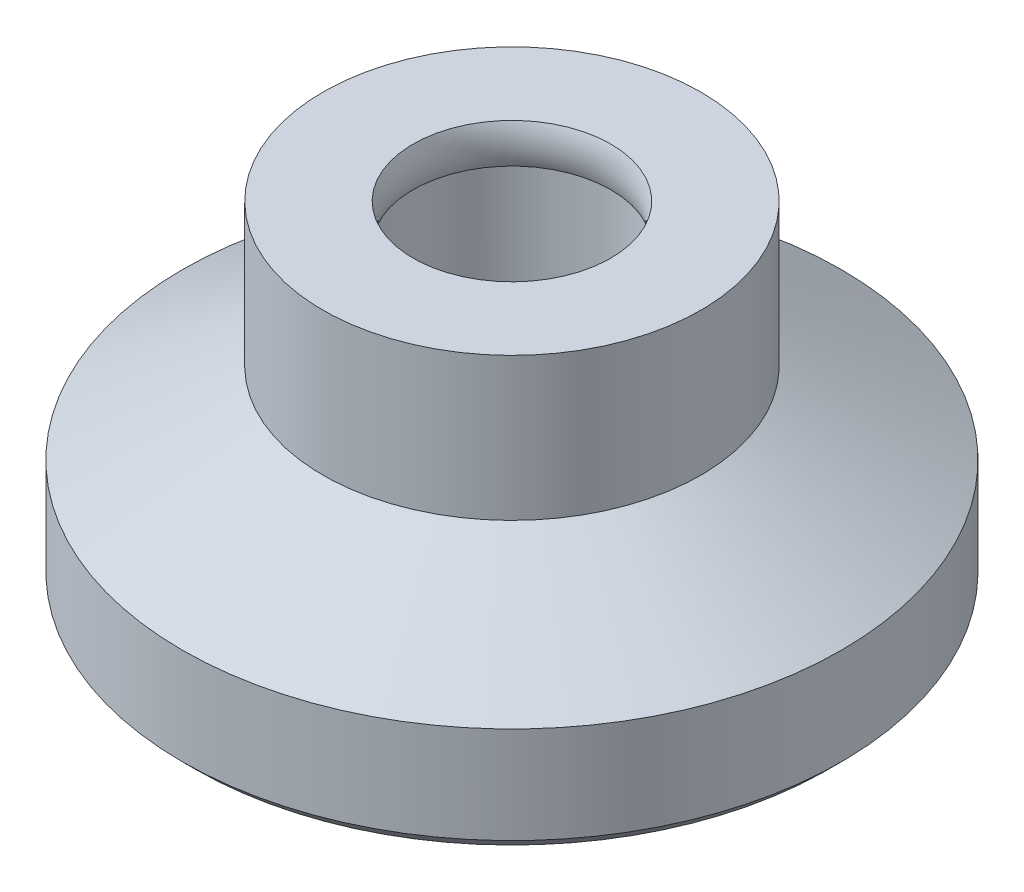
ISO-10303-21;
HEADER;
FILE_DESCRIPTION(('STEP AP214'),'2;1');
FILE_NAME('part.step','',(''),(''),'','','');
FILE_SCHEMA(('AUTOMOTIVE_DESIGN { 1 0 10303 214 1 1 1 1 }'));
ENDSEC;
DATA;
#1=APPLICATION_CONTEXT('core data for automotive mechanical design processes');
#2=APPLICATION_PROTOCOL_DEFINITION('international standard','automotive_design',2000,#1);
#3=PRODUCT_CONTEXT('',#1,'mechanical');
#4=PRODUCT('Part','Part','',(#3));
#5=PRODUCT_RELATED_PRODUCT_CATEGORY('part','',(#4));
#6=PRODUCT_DEFINITION_FORMATION('','',#4);
#7=PRODUCT_DEFINITION_CONTEXT('part definition',#1,'design');
#8=PRODUCT_DEFINITION('design','',#6,#7);
#9=PRODUCT_DEFINITION_SHAPE('','',#8);
#10=(LENGTH_UNIT() NAMED_UNIT(*) SI_UNIT(.MILLI.,.METRE.));
#11=(NAMED_UNIT(*) PLANE_ANGLE_UNIT() SI_UNIT($,.RADIAN.));
#12=(NAMED_UNIT(*) SI_UNIT($,.STERADIAN.) SOLID_ANGLE_UNIT());
#13=UNCERTAINTY_MEASURE_WITH_UNIT(LENGTH_MEASURE(1.E-05),#10,'distance_accuracy_value','');
#14=(GEOMETRIC_REPRESENTATION_CONTEXT(3) GLOBAL_UNCERTAINTY_ASSIGNED_CONTEXT((#13)) GLOBAL_UNIT_ASSIGNED_CONTEXT((#10,
#11,#12)) REPRESENTATION_CONTEXT('',''));
#15=CARTESIAN_POINT('',(0.,0.,0.));
#16=DIRECTION('',(0.,0.,1.));
#17=DIRECTION('',(1.,0.,0.));
#18=AXIS2_PLACEMENT_3D('',#15,#16,#17);
#19=CARTESIAN_POINT('',(0.,3.8,0.));
#20=DIRECTION('',(0.,-1.,0.));
#21=DIRECTION('',(0.,0.,-1.));
#22=AXIS2_PLACEMENT_3D('',#19,#20,#21);
#23=CYLINDRICAL_SURFACE('',#22,4.3);
#24=CARTESIAN_POINT('',(0.,0.547520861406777,0.));
#25=DIRECTION('',(0.,1.,0.));
#26=DIRECTION('',(0.,0.,1.));
#27=AXIS2_PLACEMENT_3D('',#24,#25,#26);
#28=CIRCLE('',#27,4.3);
#29=CARTESIAN_POINT('',(0.,0.547520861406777,-4.3));
#30=VERTEX_POINT('',#29);
#31=EDGE_CURVE('E91',#30,#30,#28,.T.);
#32=CARTESIAN_POINT('',(0.,3.8,0.));
#33=DIRECTION('',(0.,1.,0.));
#34=DIRECTION('',(0.,0.,1.));
#35=AXIS2_PLACEMENT_3D('',#32,#33,#34);
#36=CIRCLE('',#35,4.3);
#37=CARTESIAN_POINT('',(0.,3.8,-4.3));
#38=VERTEX_POINT('',#37);
#39=EDGE_CURVE('E93',#38,#38,#36,.T.);
#40=CARTESIAN_POINT('',(0.,0.547520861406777,-4.3));
#41=CARTESIAN_POINT('',(0.,0.58140085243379,-4.3));
#42=CARTESIAN_POINT('',(0.,0.615280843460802,-4.3));
#43=CARTESIAN_POINT('',(0.,0.683040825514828,-4.3));
#44=CARTESIAN_POINT('',(0.,0.71692081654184,-4.3));
#45=CARTESIAN_POINT('',(0.,0.784680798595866,-4.3));
#46=CARTESIAN_POINT('',(0.,0.818560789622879,-4.3));
#47=CARTESIAN_POINT('',(0.,0.886320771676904,-4.3));
#48=CARTESIAN_POINT('',(0.,0.920200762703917,-4.3));
#49=CARTESIAN_POINT('',(0.,0.987960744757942,-4.3));
#50=CARTESIAN_POINT('',(0.,1.02184073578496,-4.3));
#51=CARTESIAN_POINT('',(0.,1.08960071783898,-4.3));
#52=CARTESIAN_POINT('',(0.,1.12348070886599,-4.3));
#53=CARTESIAN_POINT('',(0.,1.19124069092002,-4.3));
#54=CARTESIAN_POINT('',(0.,1.22512068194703,-4.3));
#55=CARTESIAN_POINT('',(0.,1.29288066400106,-4.3));
#56=CARTESIAN_POINT('',(0.,1.32676065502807,-4.3));
#57=CARTESIAN_POINT('',(0.,1.3945206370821,-4.3));
#58=CARTESIAN_POINT('',(0.,1.42840062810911,-4.3));
#59=CARTESIAN_POINT('',(0.,1.49616061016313,-4.3));
#60=CARTESIAN_POINT('',(0.,1.53004060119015,-4.3));
#61=CARTESIAN_POINT('',(0.,1.59780058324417,-4.3));
#62=CARTESIAN_POINT('',(0.,1.63168057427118,-4.3));
#63=CARTESIAN_POINT('',(0.,1.69944055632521,-4.3));
#64=CARTESIAN_POINT('',(0.,1.73332054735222,-4.3));
#65=CARTESIAN_POINT('',(0.,1.80108052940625,-4.3));
#66=CARTESIAN_POINT('',(0.,1.83496052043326,-4.3));
#67=CARTESIAN_POINT('',(0.,1.90272050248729,-4.3));
#68=CARTESIAN_POINT('',(0.,1.9366004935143,-4.3));
#69=CARTESIAN_POINT('',(0.,2.00436047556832,-4.3));
#70=CARTESIAN_POINT('',(0.,2.03824046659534,-4.3));
#71=CARTESIAN_POINT('',(0.,2.10600044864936,-4.3));
#72=CARTESIAN_POINT('',(0.,2.13988043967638,-4.3));
#73=CARTESIAN_POINT('',(0.,2.2076404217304,-4.3));
#74=CARTESIAN_POINT('',(0.,2.24152041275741,-4.3));
#75=CARTESIAN_POINT('',(0.,2.30928039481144,-4.3));
#76=CARTESIAN_POINT('',(0.,2.34316038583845,-4.3));
#77=CARTESIAN_POINT('',(0.,2.41092036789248,-4.3));
#78=CARTESIAN_POINT('',(0.,2.44480035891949,-4.3));
#79=CARTESIAN_POINT('',(0.,2.51256034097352,-4.3));
#80=CARTESIAN_POINT('',(0.,2.54644033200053,-4.3));
#81=CARTESIAN_POINT('',(0.,2.61420031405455,-4.3));
#82=CARTESIAN_POINT('',(0.,2.64808030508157,-4.3));
#83=CARTESIAN_POINT('',(0.,2.71584028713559,-4.3));
#84=CARTESIAN_POINT('',(0.,2.7497202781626,-4.3));
#85=CARTESIAN_POINT('',(0.,2.81748026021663,-4.3));
#86=CARTESIAN_POINT('',(0.,2.85136025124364,-4.3));
#87=CARTESIAN_POINT('',(0.,2.91912023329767,-4.3));
#88=CARTESIAN_POINT('',(0.,2.95300022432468,-4.3));
#89=CARTESIAN_POINT('',(0.,3.02076020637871,-4.3));
#90=CARTESIAN_POINT('',(0.,3.05464019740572,-4.3));
#91=CARTESIAN_POINT('',(0.,3.12240017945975,-4.3));
#92=CARTESIAN_POINT('',(0.,3.15628017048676,-4.3));
#93=CARTESIAN_POINT('',(0.,3.22404015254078,-4.3));
#94=CARTESIAN_POINT('',(0.,3.2579201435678,-4.3));
#95=CARTESIAN_POINT('',(0.,3.32568012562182,-4.3));
#96=CARTESIAN_POINT('',(0.,3.35956011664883,-4.3));
#97=CARTESIAN_POINT('',(0.,3.42732009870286,-4.3));
#98=CARTESIAN_POINT('',(0.,3.46120008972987,-4.3));
#99=CARTESIAN_POINT('',(0.,3.5289600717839,-4.3));
#100=CARTESIAN_POINT('',(0.,3.56284006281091,-4.3));
#101=CARTESIAN_POINT('',(0.,3.63060004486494,-4.3));
#102=CARTESIAN_POINT('',(0.,3.66448003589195,-4.3));
#103=CARTESIAN_POINT('',(0.,3.73224001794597,-4.3));
#104=CARTESIAN_POINT('',(0.,3.76612000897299,-4.3));
#105=CARTESIAN_POINT('',(0.,3.8,-4.3));
#106=B_SPLINE_CURVE_WITH_KNOTS('',3,(#40,#41,#42,#43,#44,#45,#46,#47,#48,#49,#50,#51,#52,#53,
#54,#55,#56,#57,#58,#59,#60,#61,#62,#63,#64,#65,#66,#67,#68,#69,#70,#71,#72,#73,#74,#75,#76,#77,
#78,#79,#80,#81,#82,#83,#84,#85,#86,#87,#88,#89,#90,#91,#92,#93,#94,#95,#96,#97,#98,#99,#100,
#101,#102,#103,#104,#105),.UNSPECIFIED.,.F.,.F.,(4,2,2,2,2,2,2,2,2,2,2,2,2,2,2,2,2,2,2,2,2,2,2,
2,2,2,2,2,2,2,2,2,4),(0.,0.101639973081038,0.203279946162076,0.304919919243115,
0.406559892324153,0.508199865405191,0.609839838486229,0.711479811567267,0.813119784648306,
0.914759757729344,1.01639973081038,1.11803970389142,1.21967967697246,1.3213196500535,
1.42295962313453,1.52459959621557,1.62623956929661,1.72787954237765,1.82951951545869,
1.93115948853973,2.03279946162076,2.1344394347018,2.23607940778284,2.33771938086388,
2.43935935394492,2.54099932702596,2.64263930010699,2.74427927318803,2.84591924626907,
2.94755921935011,3.04919919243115,3.15083916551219,3.25247913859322),.UNSPECIFIED.);
#107=EDGE_CURVE('BSEAM37',#30,#38,#106,.T.);
#108=ORIENTED_EDGE('',*,*,#31,.T.);
#109=ORIENTED_EDGE('',*,*,#39,.F.);
#110=ORIENTED_EDGE('',*,*,#107,.T.);
#111=ORIENTED_EDGE('',*,*,#107,.F.);
#112=EDGE_LOOP('',(#108,#110,#109,#111));
#113=FACE_BOUND('',#112,.T.);
#114=ADVANCED_FACE('F37',(#113),#23,.T.);
#115=CARTESIAN_POINT('',(0.,3.8,0.));
#116=DIRECTION('',(0.,1.,0.));
#117=DIRECTION('',(0.,0.,1.));
#118=AXIS2_PLACEMENT_3D('',#115,#116,#117);
#119=PLANE('',#118);
#120=CARTESIAN_POINT('',(0.,3.8,0.));
#121=DIRECTION('',(0.,-1.,0.));
#122=DIRECTION('',(0.,0.,-1.));
#123=AXIS2_PLACEMENT_3D('',#120,#121,#122);
#124=CIRCLE('',#123,2.25);
#125=CARTESIAN_POINT('',(0.,3.8,-2.25));
#126=VERTEX_POINT('',#125);
#127=EDGE_CURVE('E114',#126,#126,#124,.T.);
#128=ORIENTED_EDGE('',*,*,#127,.T.);
#129=EDGE_LOOP('',(#128));
#130=FACE_BOUND('',#129,.T.);
#131=ORIENTED_EDGE('',*,*,#39,.T.);
#132=EDGE_LOOP('',(#131));
#133=FACE_BOUND('',#132,.T.);
#134=ADVANCED_FACE('F65',(#130,#133),#119,.T.);
#135=CARTESIAN_POINT('',(0.,0.547520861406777,0.));
#136=DIRECTION('',(0.,-1.,0.));
#137=DIRECTION('',(0.,0.,-1.));
#138=AXIS2_PLACEMENT_3D('',#135,#136,#137);
#139=CONICAL_SURFACE('',#138,4.3,1.0471975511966);
#140=CARTESIAN_POINT('',(0.,-1.3,0.));
#141=DIRECTION('',(0.,1.,0.));
#142=DIRECTION('',(0.,0.,1.));
#143=AXIS2_PLACEMENT_3D('',#140,#141,#142);
#144=CIRCLE('',#143,7.5);
#145=CARTESIAN_POINT('',(0.,-1.3,7.5));
#146=VERTEX_POINT('',#145);
#147=EDGE_CURVE('E89',#146,#146,#144,.T.);
#148=ORIENTED_EDGE('',*,*,#147,.T.);
#149=EDGE_LOOP('',(#148));
#150=FACE_BOUND('',#149,.T.);
#151=ORIENTED_EDGE('',*,*,#31,.F.);
#152=EDGE_LOOP('',(#151));
#153=FACE_BOUND('',#152,.T.);
#154=ADVANCED_FACE('F70',(#150,#153),#139,.T.);
#155=CARTESIAN_POINT('',(0.,-3.8,0.));
#156=DIRECTION('',(0.,1.,0.));
#157=DIRECTION('',(0.,0.,1.));
#158=AXIS2_PLACEMENT_3D('',#155,#156,#157);
#159=PLANE('',#158);
#160=CARTESIAN_POINT('',(0.,-3.8,0.));
#161=DIRECTION('',(0.,1.,0.));
#162=DIRECTION('',(0.,0.,1.));
#163=AXIS2_PLACEMENT_3D('',#160,#161,#162);
#164=CIRCLE('',#163,7.2);
#165=CARTESIAN_POINT('',(0.,-3.8,7.2));
#166=VERTEX_POINT('',#165);
#167=EDGE_CURVE('E45',#166,#166,#164,.F.);
#168=ORIENTED_EDGE('',*,*,#167,.T.);
#169=EDGE_LOOP('',(#168));
#170=FACE_BOUND('',#169,.T.);
#171=ADVANCED_FACE('F76',(#170),#159,.F.);
#172=CARTESIAN_POINT('',(0.,-1.3,0.));
#173=DIRECTION('',(0.,-1.,0.));
#174=DIRECTION('',(0.,0.,-1.));
#175=AXIS2_PLACEMENT_3D('',#172,#173,#174);
#176=CYLINDRICAL_SURFACE('',#175,7.5);
#177=CARTESIAN_POINT('',(0.,-3.5,0.));
#178=DIRECTION('',(0.,1.,0.));
#179=DIRECTION('',(0.,0.,1.));
#180=AXIS2_PLACEMENT_3D('',#177,#178,#179);
#181=CIRCLE('',#180,7.5);
#182=CARTESIAN_POINT('',(0.,-3.5,7.5));
#183=VERTEX_POINT('',#182);
#184=EDGE_CURVE('E11',#183,#183,#181,.T.);
#185=ORIENTED_EDGE('',*,*,#184,.T.);
#186=EDGE_LOOP('',(#185));
#187=FACE_BOUND('',#186,.T.);
#188=ORIENTED_EDGE('',*,*,#147,.F.);
#189=EDGE_LOOP('',(#188));
#190=FACE_BOUND('',#189,.T.);
#191=ADVANCED_FACE('F60',(#187,#190),#176,.T.);
#192=CARTESIAN_POINT('',(0.,-3.8,0.));
#193=DIRECTION('',(0.,1.,0.));
#194=DIRECTION('',(0.,0.,1.));
#195=AXIS2_PLACEMENT_3D('',#192,#193,#194);
#196=CONICAL_SURFACE('',#195,7.2,0.78539816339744);
#197=ORIENTED_EDGE('',*,*,#184,.F.);
#198=EDGE_LOOP('',(#197));
#199=FACE_BOUND('',#198,.T.);
#200=ORIENTED_EDGE('',*,*,#167,.F.);
#201=EDGE_LOOP('',(#200));
#202=FACE_BOUND('',#201,.T.);
#203=ADVANCED_FACE('F39',(#199,#202),#196,.T.);
#204=CARTESIAN_POINT('',(0.,-1.3,0.));
#205=DIRECTION('',(0.,1.,0.));
#206=DIRECTION('',(0.,0.,1.));
#207=AXIS2_PLACEMENT_3D('',#204,#205,#206);
#208=CONICAL_SURFACE('',#207,0.,1.04719755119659);
#209=CARTESIAN_POINT('',(0.,-0.000961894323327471,0.));
#210=DIRECTION('',(0.,-1.,0.));
#211=DIRECTION('',(0.,0.,-1.));
#212=AXIS2_PLACEMENT_3D('',#209,#210,#211);
#213=CIRCLE('',#212,2.25);
#214=CARTESIAN_POINT('',(0.,-0.000961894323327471,-2.25));
#215=VERTEX_POINT('',#214);
#216=EDGE_CURVE('E101',#215,#215,#213,.T.);
#217=ORIENTED_EDGE('',*,*,#216,.F.);
#218=EDGE_LOOP('',(#217));
#219=FACE_BOUND('',#218,.T.);
#220=CARTESIAN_POINT('',(0.,-1.3,0.));
#221=VERTEX_POINT('',#220);
#222=VERTEX_LOOP('',#221);
#223=FACE_BOUND('',#222,.T.);
#224=ADVANCED_FACE('F48',(#219,#223),#208,.F.);
#225=CARTESIAN_POINT('',(0.,0.,0.));
#226=DIRECTION('',(0.,-1.,0.));
#227=DIRECTION('',(0.,0.,-1.));
#228=AXIS2_PLACEMENT_3D('',#225,#226,#227);
#229=CYLINDRICAL_SURFACE('',#228,2.25);
#230=CARTESIAN_POINT('',(0.,2.9,0.));
#231=DIRECTION('',(0.,-1.,0.));
#232=DIRECTION('',(0.,0.,-1.));
#233=AXIS2_PLACEMENT_3D('',#230,#231,#232);
#234=CIRCLE('',#233,2.25);
#235=CARTESIAN_POINT('',(0.,2.9,-2.25));
#236=VERTEX_POINT('',#235);
#237=EDGE_CURVE('E110',#236,#236,#234,.T.);
#238=ORIENTED_EDGE('',*,*,#237,.F.);
#239=EDGE_LOOP('',(#238));
#240=FACE_BOUND('',#239,.T.);
#241=ORIENTED_EDGE('',*,*,#216,.T.);
#242=EDGE_LOOP('',(#241));
#243=FACE_BOUND('',#242,.T.);
#244=ADVANCED_FACE('F50',(#240,#243),#229,.F.);
#245=CARTESIAN_POINT('',(0.,3.35,0.));
#246=DIRECTION('',(0.,-1.,0.));
#247=DIRECTION('',(0.,0.,-1.));
#248=AXIS2_PLACEMENT_3D('',#245,#246,#247);
#249=TOROIDAL_SURFACE('',#248,3.33000000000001,1.17000000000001);
#250=ORIENTED_EDGE('',*,*,#127,.F.);
#251=EDGE_LOOP('',(#250));
#252=FACE_BOUND('',#251,.T.);
#253=ORIENTED_EDGE('',*,*,#237,.T.);
#254=EDGE_LOOP('',(#253));
#255=FACE_BOUND('',#254,.T.);
#256=ADVANCED_FACE('F57',(#252,#255),#249,.T.);
#257=CLOSED_SHELL('',(#114,#134,#154,#171,#191,#203,#224,#244,#256));
#258=MANIFOLD_SOLID_BREP('B2',#257);
#259=ADVANCED_BREP_SHAPE_REPRESENTATION('',(#18,#258),#14);
#260=SHAPE_DEFINITION_REPRESENTATION(#9,#259);
ENDSEC;
END-ISO-10303-21;
